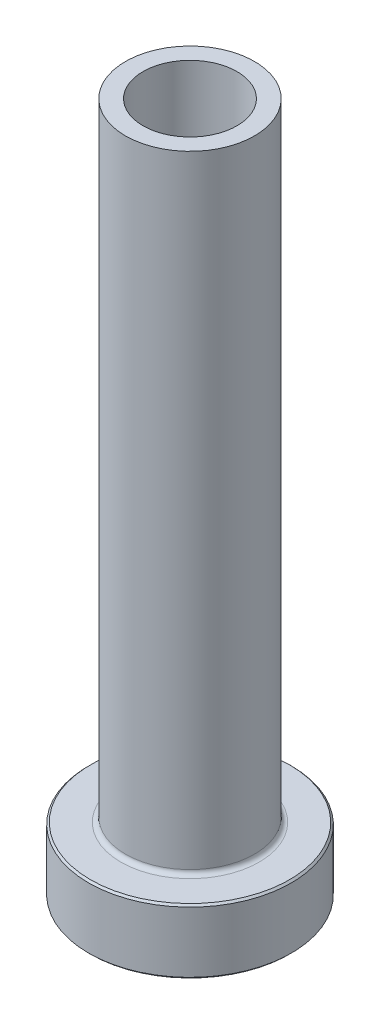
ISO-10303-21;
HEADER;
FILE_DESCRIPTION(('STEP AP214'),'2;1');
FILE_NAME('part.step','',(''),(''),'','','');
FILE_SCHEMA(('AUTOMOTIVE_DESIGN { 1 0 10303 214 1 1 1 1 }'));
ENDSEC;
DATA;
#1=APPLICATION_CONTEXT('core data for automotive mechanical design processes');
#2=APPLICATION_PROTOCOL_DEFINITION('international standard','automotive_design',2000,#1);
#3=PRODUCT_CONTEXT('',#1,'mechanical');
#4=PRODUCT('Part','Part','',(#3));
#5=PRODUCT_RELATED_PRODUCT_CATEGORY('part','',(#4));
#6=PRODUCT_DEFINITION_FORMATION('','',#4);
#7=PRODUCT_DEFINITION_CONTEXT('part definition',#1,'design');
#8=PRODUCT_DEFINITION('design','',#6,#7);
#9=PRODUCT_DEFINITION_SHAPE('','',#8);
#10=(LENGTH_UNIT() NAMED_UNIT(*) SI_UNIT(.MILLI.,.METRE.));
#11=(NAMED_UNIT(*) PLANE_ANGLE_UNIT() SI_UNIT($,.RADIAN.));
#12=(NAMED_UNIT(*) SI_UNIT($,.STERADIAN.) SOLID_ANGLE_UNIT());
#13=UNCERTAINTY_MEASURE_WITH_UNIT(LENGTH_MEASURE(1.E-05),#10,'distance_accuracy_value','');
#14=(GEOMETRIC_REPRESENTATION_CONTEXT(3) GLOBAL_UNCERTAINTY_ASSIGNED_CONTEXT((#13)) GLOBAL_UNIT_ASSIGNED_CONTEXT((#10,
#11,#12)) REPRESENTATION_CONTEXT('',''));
#15=CARTESIAN_POINT('',(0.,0.,0.));
#16=DIRECTION('',(0.,0.,1.));
#17=DIRECTION('',(1.,0.,0.));
#18=AXIS2_PLACEMENT_3D('',#15,#16,#17);
#19=CARTESIAN_POINT('',(0.,92.1876809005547,0.));
#20=DIRECTION('',(0.,1.,0.));
#21=DIRECTION('',(0.,0.,1.));
#22=AXIS2_PLACEMENT_3D('',#19,#20,#21);
#23=CYLINDRICAL_SURFACE('',#22,5.10000000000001);
#24=CARTESIAN_POINT('',(0.,75.,0.));
#25=DIRECTION('',(0.,1.,0.));
#26=DIRECTION('',(0.,0.,1.));
#27=AXIS2_PLACEMENT_3D('',#24,#25,#26);
#28=CIRCLE('',#27,5.10000000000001);
#29=CARTESIAN_POINT('',(0.,75.,5.10000000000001));
#30=VERTEX_POINT('',#29);
#31=EDGE_CURVE('E62',#30,#30,#28,.T.);
#32=ORIENTED_EDGE('',*,*,#31,.T.);
#33=EDGE_LOOP('',(#32));
#34=FACE_BOUND('',#33,.T.);
#35=CARTESIAN_POINT('',(0.,20.,0.));
#36=DIRECTION('',(0.,1.,0.));
#37=DIRECTION('',(0.,0.,1.));
#38=AXIS2_PLACEMENT_3D('',#35,#36,#37);
#39=CIRCLE('',#38,5.10000000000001);
#40=CARTESIAN_POINT('',(0.,20.,5.10000000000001));
#41=VERTEX_POINT('',#40);
#42=EDGE_CURVE('E71',#41,#41,#39,.T.);
#43=ORIENTED_EDGE('',*,*,#42,.F.);
#44=EDGE_LOOP('',(#43));
#45=FACE_BOUND('',#44,.T.);
#46=ADVANCED_FACE('F30',(#34,#45),#23,.F.);
#47=CARTESIAN_POINT('',(-5.10000000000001,75.,0.));
#48=DIRECTION('',(0.,1.,0.));
#49=DIRECTION('',(0.,0.,1.));
#50=AXIS2_PLACEMENT_3D('',#47,#48,#49);
#51=PLANE('',#50);
#52=CARTESIAN_POINT('',(0.,75.,0.));
#53=DIRECTION('',(0.,1.,0.));
#54=DIRECTION('',(0.,0.,1.));
#55=AXIS2_PLACEMENT_3D('',#52,#53,#54);
#56=CIRCLE('',#55,7.);
#57=CARTESIAN_POINT('',(0.,75.,7.));
#58=VERTEX_POINT('',#57);
#59=EDGE_CURVE('E65',#58,#58,#56,.T.);
#60=ORIENTED_EDGE('',*,*,#59,.T.);
#61=EDGE_LOOP('',(#60));
#62=FACE_BOUND('',#61,.T.);
#63=ORIENTED_EDGE('',*,*,#31,.F.);
#64=EDGE_LOOP('',(#63));
#65=FACE_BOUND('',#64,.T.);
#66=ADVANCED_FACE('F79',(#62,#65),#51,.T.);
#67=CARTESIAN_POINT('',(0.,92.1876809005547,0.));
#68=DIRECTION('',(0.,1.,0.));
#69=DIRECTION('',(0.,0.,1.));
#70=AXIS2_PLACEMENT_3D('',#67,#68,#69);
#71=CYLINDRICAL_SURFACE('',#70,6.99999999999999);
#72=CARTESIAN_POINT('',(0.,7.50000000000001,0.));
#73=DIRECTION('',(0.,1.,0.));
#74=DIRECTION('',(0.,0.,1.));
#75=AXIS2_PLACEMENT_3D('',#72,#73,#74);
#76=CIRCLE('',#75,6.99999999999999);
#77=CARTESIAN_POINT('',(0.,7.50000000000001,6.99999999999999));
#78=VERTEX_POINT('',#77);
#79=EDGE_CURVE('E59',#78,#78,#76,.T.);
#80=ORIENTED_EDGE('',*,*,#79,.T.);
#81=EDGE_LOOP('',(#80));
#82=FACE_BOUND('',#81,.T.);
#83=ORIENTED_EDGE('',*,*,#59,.F.);
#84=EDGE_LOOP('',(#83));
#85=FACE_BOUND('',#84,.T.);
#86=ADVANCED_FACE('F85',(#82,#85),#71,.T.);
#87=CARTESIAN_POINT('',(-6.99999999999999,7.,0.));
#88=DIRECTION('',(0.,1.,0.));
#89=DIRECTION('',(0.,0.,1.));
#90=AXIS2_PLACEMENT_3D('',#87,#88,#89);
#91=PLANE('',#90);
#92=CARTESIAN_POINT('',(0.,7.,0.));
#93=DIRECTION('',(0.,1.,0.));
#94=DIRECTION('',(0.,0.,1.));
#95=AXIS2_PLACEMENT_3D('',#92,#93,#94);
#96=CIRCLE('',#95,10.8);
#97=CARTESIAN_POINT('',(0.,7.,10.8));
#98=VERTEX_POINT('',#97);
#99=EDGE_CURVE('E53',#98,#98,#96,.T.);
#100=ORIENTED_EDGE('',*,*,#99,.T.);
#101=EDGE_LOOP('',(#100));
#102=FACE_BOUND('',#101,.T.);
#103=CARTESIAN_POINT('',(0.,7.,0.));
#104=DIRECTION('',(0.,1.,0.));
#105=DIRECTION('',(0.,0.,1.));
#106=AXIS2_PLACEMENT_3D('',#103,#104,#105);
#107=CIRCLE('',#106,7.49999999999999);
#108=CARTESIAN_POINT('',(0.,7.,7.49999999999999));
#109=VERTEX_POINT('',#108);
#110=EDGE_CURVE('E56',#109,#109,#107,.F.);
#111=ORIENTED_EDGE('',*,*,#110,.T.);
#112=EDGE_LOOP('',(#111));
#113=FACE_BOUND('',#112,.T.);
#114=ADVANCED_FACE('F111',(#102,#113),#91,.T.);
#115=CARTESIAN_POINT('',(0.,92.1876809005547,0.));
#116=DIRECTION('',(0.,1.,0.));
#117=DIRECTION('',(0.,0.,1.));
#118=AXIS2_PLACEMENT_3D('',#115,#116,#117);
#119=CYLINDRICAL_SURFACE('',#118,11.);
#120=CARTESIAN_POINT('',(0.,6.80000000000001,0.));
#121=DIRECTION('',(0.,1.,0.));
#122=DIRECTION('',(0.,0.,1.));
#123=AXIS2_PLACEMENT_3D('',#120,#121,#122);
#124=CIRCLE('',#123,11.);
#125=CARTESIAN_POINT('',(0.,6.80000000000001,11.));
#126=VERTEX_POINT('',#125);
#127=EDGE_CURVE('E45',#126,#126,#124,.F.);
#128=ORIENTED_EDGE('',*,*,#127,.T.);
#129=EDGE_LOOP('',(#128));
#130=FACE_BOUND('',#129,.T.);
#131=CARTESIAN_POINT('',(0.,0.200000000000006,0.));
#132=DIRECTION('',(0.,-1.,0.));
#133=DIRECTION('',(0.,0.,-1.));
#134=AXIS2_PLACEMENT_3D('',#131,#132,#133);
#135=CIRCLE('',#134,11.);
#136=CARTESIAN_POINT('',(0.,0.200000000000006,-11.));
#137=VERTEX_POINT('',#136);
#138=EDGE_CURVE('E50',#137,#137,#135,.F.);
#139=ORIENTED_EDGE('',*,*,#138,.T.);
#140=EDGE_LOOP('',(#139));
#141=FACE_BOUND('',#140,.T.);
#142=ADVANCED_FACE('F108',(#130,#141),#119,.T.);
#143=CARTESIAN_POINT('',(-11.,0.,0.));
#144=DIRECTION('',(0.,-1.,0.));
#145=DIRECTION('',(0.,0.,-1.));
#146=AXIS2_PLACEMENT_3D('',#143,#144,#145);
#147=PLANE('',#146);
#148=CARTESIAN_POINT('',(0.,0.,0.));
#149=DIRECTION('',(0.,-1.,0.));
#150=DIRECTION('',(0.,0.,-1.));
#151=AXIS2_PLACEMENT_3D('',#148,#149,#150);
#152=CIRCLE('',#151,5.84999999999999);
#153=CARTESIAN_POINT('',(0.,0.,-5.84999999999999));
#154=VERTEX_POINT('',#153);
#155=EDGE_CURVE('E37',#154,#154,#152,.F.);
#156=ORIENTED_EDGE('',*,*,#155,.T.);
#157=EDGE_LOOP('',(#156));
#158=FACE_BOUND('',#157,.T.);
#159=CARTESIAN_POINT('',(0.,0.,0.));
#160=DIRECTION('',(0.,-1.,0.));
#161=DIRECTION('',(0.,0.,-1.));
#162=AXIS2_PLACEMENT_3D('',#159,#160,#161);
#163=CIRCLE('',#162,10.8);
#164=CARTESIAN_POINT('',(0.,0.,-10.8));
#165=VERTEX_POINT('',#164);
#166=EDGE_CURVE('E41',#165,#165,#163,.T.);
#167=ORIENTED_EDGE('',*,*,#166,.T.);
#168=EDGE_LOOP('',(#167));
#169=FACE_BOUND('',#168,.T.);
#170=ADVANCED_FACE('F110',(#158,#169),#147,.T.);
#171=CARTESIAN_POINT('',(0.,92.1876809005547,0.));
#172=DIRECTION('',(0.,1.,0.));
#173=DIRECTION('',(0.,0.,1.));
#174=AXIS2_PLACEMENT_3D('',#171,#172,#173);
#175=CYLINDRICAL_SURFACE('',#174,5.34999999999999);
#176=CARTESIAN_POINT('',(0.,0.5,0.));
#177=DIRECTION('',(0.,-1.,0.));
#178=DIRECTION('',(0.,0.,-1.));
#179=AXIS2_PLACEMENT_3D('',#176,#177,#178);
#180=CIRCLE('',#179,5.34999999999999);
#181=CARTESIAN_POINT('',(0.,0.5,-5.34999999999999));
#182=VERTEX_POINT('',#181);
#183=EDGE_CURVE('E10',#182,#182,#180,.T.);
#184=ORIENTED_EDGE('',*,*,#183,.T.);
#185=EDGE_LOOP('',(#184));
#186=FACE_BOUND('',#185,.T.);
#187=CARTESIAN_POINT('',(0.,8.00000000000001,0.));
#188=DIRECTION('',(0.,1.,0.));
#189=DIRECTION('',(0.,0.,1.));
#190=AXIS2_PLACEMENT_3D('',#187,#188,#189);
#191=CIRCLE('',#190,5.34999999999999);
#192=CARTESIAN_POINT('',(0.,8.00000000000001,5.34999999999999));
#193=VERTEX_POINT('',#192);
#194=EDGE_CURVE('E68',#193,#193,#191,.T.);
#195=ORIENTED_EDGE('',*,*,#194,.T.);
#196=EDGE_LOOP('',(#195));
#197=FACE_BOUND('',#196,.T.);
#198=ADVANCED_FACE('F118',(#186,#197),#175,.F.);
#199=CARTESIAN_POINT('',(0.,8.00000000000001,0.));
#200=DIRECTION('',(0.,-1.,0.));
#201=DIRECTION('',(0.,0.,-1.));
#202=AXIS2_PLACEMENT_3D('',#199,#200,#201);
#203=CONICAL_SURFACE('',#202,5.34999999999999,0.0208303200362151);
#204=ORIENTED_EDGE('',*,*,#42,.T.);
#205=EDGE_LOOP('',(#204));
#206=FACE_BOUND('',#205,.T.);
#207=ORIENTED_EDGE('',*,*,#194,.F.);
#208=EDGE_LOOP('',(#207));
#209=FACE_BOUND('',#208,.T.);
#210=ADVANCED_FACE('F75',(#206,#209),#203,.F.);
#211=CARTESIAN_POINT('',(0.,7.50000000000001,0.));
#212=DIRECTION('',(0.,1.,0.));
#213=DIRECTION('',(0.,0.,1.));
#214=AXIS2_PLACEMENT_3D('',#211,#212,#213);
#215=TOROIDAL_SURFACE('',#214,7.49999999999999,0.5);
#216=ORIENTED_EDGE('',*,*,#110,.F.);
#217=EDGE_LOOP('',(#216));
#218=FACE_BOUND('',#217,.T.);
#219=ORIENTED_EDGE('',*,*,#79,.F.);
#220=EDGE_LOOP('',(#219));
#221=FACE_BOUND('',#220,.T.);
#222=ADVANCED_FACE('F90',(#218,#221),#215,.F.);
#223=CARTESIAN_POINT('',(0.,7.00000000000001,0.));
#224=DIRECTION('',(0.,-1.,0.));
#225=DIRECTION('',(0.,0.,-1.));
#226=AXIS2_PLACEMENT_3D('',#223,#224,#225);
#227=CONICAL_SURFACE('',#226,10.8,0.785398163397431);
#228=ORIENTED_EDGE('',*,*,#127,.F.);
#229=EDGE_LOOP('',(#228));
#230=FACE_BOUND('',#229,.T.);
#231=ORIENTED_EDGE('',*,*,#99,.F.);
#232=EDGE_LOOP('',(#231));
#233=FACE_BOUND('',#232,.T.);
#234=ADVANCED_FACE('F93',(#230,#233),#227,.T.);
#235=CARTESIAN_POINT('',(0.,0.200000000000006,0.));
#236=DIRECTION('',(0.,1.,0.));
#237=DIRECTION('',(0.,0.,1.));
#238=AXIS2_PLACEMENT_3D('',#235,#236,#237);
#239=CONICAL_SURFACE('',#238,11.,0.785398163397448);
#240=ORIENTED_EDGE('',*,*,#166,.F.);
#241=EDGE_LOOP('',(#240));
#242=FACE_BOUND('',#241,.T.);
#243=ORIENTED_EDGE('',*,*,#138,.F.);
#244=EDGE_LOOP('',(#243));
#245=FACE_BOUND('',#244,.T.);
#246=ADVANCED_FACE('F96',(#242,#245),#239,.T.);
#247=CARTESIAN_POINT('',(0.,0.,0.));
#248=DIRECTION('',(0.,-1.,0.));
#249=DIRECTION('',(0.,0.,-1.));
#250=AXIS2_PLACEMENT_3D('',#247,#248,#249);
#251=CONICAL_SURFACE('',#250,5.84999999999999,0.785398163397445);
#252=ORIENTED_EDGE('',*,*,#183,.F.);
#253=EDGE_LOOP('',(#252));
#254=FACE_BOUND('',#253,.T.);
#255=ORIENTED_EDGE('',*,*,#155,.F.);
#256=EDGE_LOOP('',(#255));
#257=FACE_BOUND('',#256,.T.);
#258=ADVANCED_FACE('F32',(#254,#257),#251,.F.);
#259=CLOSED_SHELL('',(#46,#66,#86,#114,#142,#170,#198,#210,#222,#234,#246,#258));
#260=MANIFOLD_SOLID_BREP('B2',#259);
#261=ADVANCED_BREP_SHAPE_REPRESENTATION('',(#18,#260),#14);
#262=SHAPE_DEFINITION_REPRESENTATION(#9,#261);
ENDSEC;
END-ISO-10303-21;
